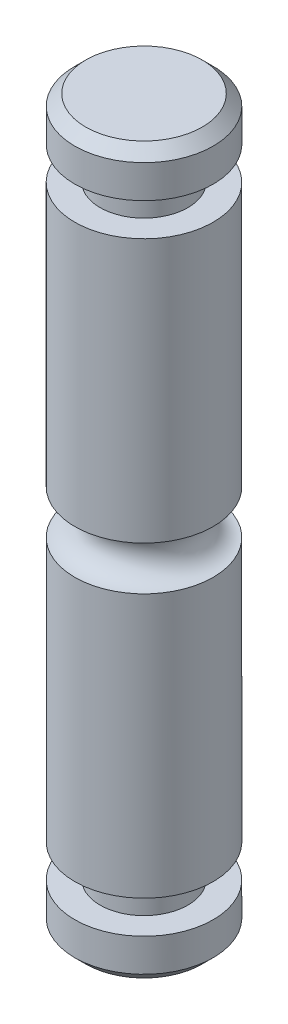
ISO-10303-21;
HEADER;
FILE_DESCRIPTION(('STEP AP214'),'2;1');
FILE_NAME('part.step','',(''),(''),'','','');
FILE_SCHEMA(('AUTOMOTIVE_DESIGN { 1 0 10303 214 1 1 1 1 }'));
ENDSEC;
DATA;
#1=APPLICATION_CONTEXT('core data for automotive mechanical design processes');
#2=APPLICATION_PROTOCOL_DEFINITION('international standard','automotive_design',2000,#1);
#3=PRODUCT_CONTEXT('',#1,'mechanical');
#4=PRODUCT('Part','Part','',(#3));
#5=PRODUCT_RELATED_PRODUCT_CATEGORY('part','',(#4));
#6=PRODUCT_DEFINITION_FORMATION('','',#4);
#7=PRODUCT_DEFINITION_CONTEXT('part definition',#1,'design');
#8=PRODUCT_DEFINITION('design','',#6,#7);
#9=PRODUCT_DEFINITION_SHAPE('','',#8);
#10=(LENGTH_UNIT() NAMED_UNIT(*) SI_UNIT(.MILLI.,.METRE.));
#11=(NAMED_UNIT(*) PLANE_ANGLE_UNIT() SI_UNIT($,.RADIAN.));
#12=(NAMED_UNIT(*) SI_UNIT($,.STERADIAN.) SOLID_ANGLE_UNIT());
#13=UNCERTAINTY_MEASURE_WITH_UNIT(LENGTH_MEASURE(1.E-05),#10,'distance_accuracy_value','');
#14=(GEOMETRIC_REPRESENTATION_CONTEXT(3) GLOBAL_UNCERTAINTY_ASSIGNED_CONTEXT((#13)) GLOBAL_UNIT_ASSIGNED_CONTEXT((#10,
#11,#12)) REPRESENTATION_CONTEXT('',''));
#15=CARTESIAN_POINT('',(0.,0.,0.));
#16=DIRECTION('',(0.,0.,1.));
#17=DIRECTION('',(1.,0.,0.));
#18=AXIS2_PLACEMENT_3D('',#15,#16,#17);
#19=CARTESIAN_POINT('',(0.,-16.5,0.));
#20=DIRECTION('',(0.,1.,0.));
#21=DIRECTION('',(0.,0.,1.));
#22=AXIS2_PLACEMENT_3D('',#19,#20,#21);
#23=CYLINDRICAL_SURFACE('',#22,3.15);
#24=CARTESIAN_POINT('',(0.,0.999999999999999,0.));
#25=DIRECTION('',(0.,-1.,0.));
#26=DIRECTION('',(0.,0.,-1.));
#27=AXIS2_PLACEMENT_3D('',#24,#25,#26);
#28=CIRCLE('',#27,3.15);
#29=CARTESIAN_POINT('',(0.,0.999999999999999,-3.15));
#30=VERTEX_POINT('',#29);
#31=EDGE_CURVE('E58',#30,#30,#28,.T.);
#32=ORIENTED_EDGE('',*,*,#31,.F.);
#33=EDGE_LOOP('',(#32));
#34=FACE_BOUND('',#33,.T.);
#35=CARTESIAN_POINT('',(0.,13.,0.));
#36=DIRECTION('',(0.,-1.,0.));
#37=DIRECTION('',(0.,0.,-1.));
#38=AXIS2_PLACEMENT_3D('',#35,#36,#37);
#39=CIRCLE('',#38,3.15);
#40=CARTESIAN_POINT('',(0.,13.,-3.15));
#41=VERTEX_POINT('',#40);
#42=EDGE_CURVE('E53',#41,#41,#39,.F.);
#43=ORIENTED_EDGE('',*,*,#42,.F.);
#44=EDGE_LOOP('',(#43));
#45=FACE_BOUND('',#44,.T.);
#46=ADVANCED_FACE('F33',(#34,#45),#23,.T.);
#47=CARTESIAN_POINT('',(0.,0.,0.));
#48=DIRECTION('',(0.,-1.,0.));
#49=DIRECTION('',(0.,0.,-1.));
#50=AXIS2_PLACEMENT_3D('',#47,#48,#49);
#51=CYLINDRICAL_SURFACE('',#50,2.);
#52=CARTESIAN_POINT('',(0.,13.,0.));
#53=DIRECTION('',(0.,-1.,0.));
#54=DIRECTION('',(0.,0.,-1.));
#55=AXIS2_PLACEMENT_3D('',#52,#53,#54);
#56=CIRCLE('',#55,2.);
#57=CARTESIAN_POINT('',(0.,13.,-2.));
#58=VERTEX_POINT('',#57);
#59=EDGE_CURVE('E73',#58,#58,#56,.T.);
#60=ORIENTED_EDGE('',*,*,#59,.F.);
#61=EDGE_LOOP('',(#60));
#62=FACE_BOUND('',#61,.T.);
#63=CARTESIAN_POINT('',(0.,14.5,0.));
#64=DIRECTION('',(0.,-1.,0.));
#65=DIRECTION('',(0.,0.,-1.));
#66=AXIS2_PLACEMENT_3D('',#63,#64,#65);
#67=CIRCLE('',#66,2.);
#68=CARTESIAN_POINT('',(0.,14.5,-2.));
#69=VERTEX_POINT('',#68);
#70=EDGE_CURVE('E57',#69,#69,#67,.T.);
#71=ORIENTED_EDGE('',*,*,#70,.T.);
#72=EDGE_LOOP('',(#71));
#73=FACE_BOUND('',#72,.T.);
#74=ADVANCED_FACE('F104',(#62,#73),#51,.T.);
#75=CARTESIAN_POINT('',(0.,13.,-2.));
#76=DIRECTION('',(0.,-1.,0.));
#77=DIRECTION('',(0.,0.,-1.));
#78=AXIS2_PLACEMENT_3D('',#75,#76,#77);
#79=PLANE('',#78);
#80=ORIENTED_EDGE('',*,*,#42,.T.);
#81=EDGE_LOOP('',(#80));
#82=FACE_BOUND('',#81,.T.);
#83=ORIENTED_EDGE('',*,*,#59,.T.);
#84=EDGE_LOOP('',(#83));
#85=FACE_BOUND('',#84,.T.);
#86=ADVANCED_FACE('F111',(#82,#85),#79,.F.);
#87=CARTESIAN_POINT('',(0.,14.5,-2.));
#88=DIRECTION('',(0.,1.,0.));
#89=DIRECTION('',(0.,0.,1.));
#90=AXIS2_PLACEMENT_3D('',#87,#88,#89);
#91=PLANE('',#90);
#92=CARTESIAN_POINT('',(0.,14.5,0.));
#93=DIRECTION('',(0.,1.,0.));
#94=DIRECTION('',(0.,0.,1.));
#95=AXIS2_PLACEMENT_3D('',#92,#93,#94);
#96=CIRCLE('',#95,3.15);
#97=CARTESIAN_POINT('',(0.,14.5,3.15));
#98=VERTEX_POINT('',#97);
#99=EDGE_CURVE('E70',#98,#98,#96,.F.);
#100=ORIENTED_EDGE('',*,*,#99,.T.);
#101=EDGE_LOOP('',(#100));
#102=FACE_BOUND('',#101,.T.);
#103=ORIENTED_EDGE('',*,*,#70,.F.);
#104=EDGE_LOOP('',(#103));
#105=FACE_BOUND('',#104,.T.);
#106=ADVANCED_FACE('F136',(#102,#105),#91,.F.);
#107=CARTESIAN_POINT('',(0.,16.5,0.));
#108=DIRECTION('',(0.,1.,0.));
#109=DIRECTION('',(0.,0.,1.));
#110=AXIS2_PLACEMENT_3D('',#107,#108,#109);
#111=PLANE('',#110);
#112=CARTESIAN_POINT('',(0.,16.5,0.));
#113=DIRECTION('',(0.,1.,0.));
#114=DIRECTION('',(0.,0.,1.));
#115=AXIS2_PLACEMENT_3D('',#112,#113,#114);
#116=CIRCLE('',#115,2.65);
#117=CARTESIAN_POINT('',(0.,16.5,2.65));
#118=VERTEX_POINT('',#117);
#119=EDGE_CURVE('E40',#118,#118,#116,.T.);
#120=ORIENTED_EDGE('',*,*,#119,.T.);
#121=EDGE_LOOP('',(#120));
#122=FACE_BOUND('',#121,.T.);
#123=ADVANCED_FACE('F132',(#122),#111,.T.);
#124=CARTESIAN_POINT('',(0.,16.,0.));
#125=DIRECTION('',(0.,1.,0.));
#126=DIRECTION('',(0.,0.,1.));
#127=AXIS2_PLACEMENT_3D('',#124,#125,#126);
#128=CIRCLE('',#127,3.15);
#129=CARTESIAN_POINT('',(0.,16.,3.15));
#130=VERTEX_POINT('',#129);
#131=EDGE_CURVE('E10',#130,#130,#128,.F.);
#132=ORIENTED_EDGE('',*,*,#131,.T.);
#133=EDGE_LOOP('',(#132));
#134=FACE_BOUND('',#133,.T.);
#135=ORIENTED_EDGE('',*,*,#99,.F.);
#136=EDGE_LOOP('',(#135));
#137=FACE_BOUND('',#136,.T.);
#138=ADVANCED_FACE('F116',(#134,#137),#23,.T.);
#139=CARTESIAN_POINT('',(0.,0.,0.));
#140=DIRECTION('',(0.,-1.,0.));
#141=DIRECTION('',(0.,0.,-1.));
#142=AXIS2_PLACEMENT_3D('',#139,#140,#141);
#143=TOROIDAL_SURFACE('',#142,3.15,0.999999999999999);
#144=CARTESIAN_POINT('',(0.,-0.999999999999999,0.));
#145=DIRECTION('',(0.,1.,0.));
#146=DIRECTION('',(0.,0.,1.));
#147=AXIS2_PLACEMENT_3D('',#144,#145,#146);
#148=CIRCLE('',#147,3.15);
#149=CARTESIAN_POINT('',(0.,-0.999999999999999,3.15));
#150=VERTEX_POINT('',#149);
#151=EDGE_CURVE('E54',#150,#150,#148,.T.);
#152=ORIENTED_EDGE('',*,*,#151,.T.);
#153=EDGE_LOOP('',(#152));
#154=FACE_BOUND('',#153,.T.);
#155=ORIENTED_EDGE('',*,*,#31,.T.);
#156=EDGE_LOOP('',(#155));
#157=FACE_BOUND('',#156,.T.);
#158=ADVANCED_FACE('F122',(#154,#157),#143,.F.);
#159=ORIENTED_EDGE('',*,*,#151,.F.);
#160=EDGE_LOOP('',(#159));
#161=FACE_BOUND('',#160,.T.);
#162=CARTESIAN_POINT('',(0.,-13.,0.));
#163=DIRECTION('',(0.,1.,0.));
#164=DIRECTION('',(0.,0.,1.));
#165=AXIS2_PLACEMENT_3D('',#162,#163,#164);
#166=CIRCLE('',#165,3.15);
#167=CARTESIAN_POINT('',(0.,-13.,3.15));
#168=VERTEX_POINT('',#167);
#169=EDGE_CURVE('E61',#168,#168,#166,.F.);
#170=ORIENTED_EDGE('',*,*,#169,.F.);
#171=EDGE_LOOP('',(#170));
#172=FACE_BOUND('',#171,.T.);
#173=ADVANCED_FACE('F90',(#161,#172),#23,.T.);
#174=CARTESIAN_POINT('',(0.,0.,0.));
#175=DIRECTION('',(0.,-1.,0.));
#176=DIRECTION('',(0.,0.,-1.));
#177=AXIS2_PLACEMENT_3D('',#174,#175,#176);
#178=CYLINDRICAL_SURFACE('',#177,2.);
#179=CARTESIAN_POINT('',(0.,-14.5,0.));
#180=DIRECTION('',(0.,-1.,0.));
#181=DIRECTION('',(0.,0.,-1.));
#182=AXIS2_PLACEMENT_3D('',#179,#180,#181);
#183=CIRCLE('',#182,2.);
#184=CARTESIAN_POINT('',(0.,-14.5,-2.));
#185=VERTEX_POINT('',#184);
#186=EDGE_CURVE('E80',#185,#185,#183,.T.);
#187=ORIENTED_EDGE('',*,*,#186,.F.);
#188=EDGE_LOOP('',(#187));
#189=FACE_BOUND('',#188,.T.);
#190=CARTESIAN_POINT('',(0.,-13.,0.));
#191=DIRECTION('',(0.,-1.,0.));
#192=DIRECTION('',(0.,0.,-1.));
#193=AXIS2_PLACEMENT_3D('',#190,#191,#192);
#194=CIRCLE('',#193,2.);
#195=CARTESIAN_POINT('',(0.,-13.,-2.));
#196=VERTEX_POINT('',#195);
#197=EDGE_CURVE('E67',#196,#196,#194,.T.);
#198=ORIENTED_EDGE('',*,*,#197,.T.);
#199=EDGE_LOOP('',(#198));
#200=FACE_BOUND('',#199,.T.);
#201=ADVANCED_FACE('F86',(#189,#200),#178,.T.);
#202=CARTESIAN_POINT('',(0.,-13.,-2.));
#203=DIRECTION('',(0.,1.,0.));
#204=DIRECTION('',(0.,0.,1.));
#205=AXIS2_PLACEMENT_3D('',#202,#203,#204);
#206=PLANE('',#205);
#207=ORIENTED_EDGE('',*,*,#169,.T.);
#208=EDGE_LOOP('',(#207));
#209=FACE_BOUND('',#208,.T.);
#210=ORIENTED_EDGE('',*,*,#197,.F.);
#211=EDGE_LOOP('',(#210));
#212=FACE_BOUND('',#211,.T.);
#213=ADVANCED_FACE('F89',(#209,#212),#206,.F.);
#214=CARTESIAN_POINT('',(0.,-14.5,-2.));
#215=DIRECTION('',(0.,-1.,0.));
#216=DIRECTION('',(0.,0.,-1.));
#217=AXIS2_PLACEMENT_3D('',#214,#215,#216);
#218=PLANE('',#217);
#219=CARTESIAN_POINT('',(0.,-14.5,0.));
#220=DIRECTION('',(0.,-1.,0.));
#221=DIRECTION('',(0.,0.,-1.));
#222=AXIS2_PLACEMENT_3D('',#219,#220,#221);
#223=CIRCLE('',#222,3.15);
#224=CARTESIAN_POINT('',(0.,-14.5,-3.15));
#225=VERTEX_POINT('',#224);
#226=EDGE_CURVE('E64',#225,#225,#223,.F.);
#227=ORIENTED_EDGE('',*,*,#226,.T.);
#228=EDGE_LOOP('',(#227));
#229=FACE_BOUND('',#228,.T.);
#230=ORIENTED_EDGE('',*,*,#186,.T.);
#231=EDGE_LOOP('',(#230));
#232=FACE_BOUND('',#231,.T.);
#233=ADVANCED_FACE('F84',(#229,#232),#218,.F.);
#234=CARTESIAN_POINT('',(0.,-16.5,0.));
#235=DIRECTION('',(0.,1.,0.));
#236=DIRECTION('',(0.,0.,1.));
#237=AXIS2_PLACEMENT_3D('',#234,#235,#236);
#238=PLANE('',#237);
#239=CARTESIAN_POINT('',(0.,-16.5,0.));
#240=DIRECTION('',(0.,1.,0.));
#241=DIRECTION('',(0.,0.,1.));
#242=AXIS2_PLACEMENT_3D('',#239,#240,#241);
#243=CIRCLE('',#242,2.65);
#244=CARTESIAN_POINT('',(0.,-16.5,2.65));
#245=VERTEX_POINT('',#244);
#246=EDGE_CURVE('E44',#245,#245,#243,.F.);
#247=ORIENTED_EDGE('',*,*,#246,.T.);
#248=EDGE_LOOP('',(#247));
#249=FACE_BOUND('',#248,.T.);
#250=ADVANCED_FACE('F100',(#249),#238,.F.);
#251=CARTESIAN_POINT('',(0.,-16.,0.));
#252=DIRECTION('',(0.,1.,0.));
#253=DIRECTION('',(0.,0.,1.));
#254=AXIS2_PLACEMENT_3D('',#251,#252,#253);
#255=CIRCLE('',#254,3.15);
#256=CARTESIAN_POINT('',(0.,-16.,3.15));
#257=VERTEX_POINT('',#256);
#258=EDGE_CURVE('E48',#257,#257,#255,.T.);
#259=ORIENTED_EDGE('',*,*,#258,.T.);
#260=EDGE_LOOP('',(#259));
#261=FACE_BOUND('',#260,.T.);
#262=ORIENTED_EDGE('',*,*,#226,.F.);
#263=EDGE_LOOP('',(#262));
#264=FACE_BOUND('',#263,.T.);
#265=ADVANCED_FACE('F107',(#261,#264),#23,.T.);
#266=CARTESIAN_POINT('',(0.,-16.,0.));
#267=DIRECTION('',(0.,1.,0.));
#268=DIRECTION('',(0.,0.,1.));
#269=AXIS2_PLACEMENT_3D('',#266,#267,#268);
#270=CONICAL_SURFACE('',#269,3.15,0.785398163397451);
#271=ORIENTED_EDGE('',*,*,#246,.F.);
#272=EDGE_LOOP('',(#271));
#273=FACE_BOUND('',#272,.T.);
#274=ORIENTED_EDGE('',*,*,#258,.F.);
#275=EDGE_LOOP('',(#274));
#276=FACE_BOUND('',#275,.T.);
#277=ADVANCED_FACE('F119',(#273,#276),#270,.T.);
#278=CARTESIAN_POINT('',(0.,16.5,0.));
#279=DIRECTION('',(0.,-1.,0.));
#280=DIRECTION('',(0.,0.,-1.));
#281=AXIS2_PLACEMENT_3D('',#278,#279,#280);
#282=CONICAL_SURFACE('',#281,2.65,0.785398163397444);
#283=ORIENTED_EDGE('',*,*,#131,.F.);
#284=EDGE_LOOP('',(#283));
#285=FACE_BOUND('',#284,.T.);
#286=ORIENTED_EDGE('',*,*,#119,.F.);
#287=EDGE_LOOP('',(#286));
#288=FACE_BOUND('',#287,.T.);
#289=ADVANCED_FACE('F35',(#285,#288),#282,.T.);
#290=CLOSED_SHELL('',(#46,#74,#86,#106,#123,#138,#158,#173,#201,#213,#233,#250,#265,#277,#289));
#291=MANIFOLD_SOLID_BREP('B2',#290);
#292=ADVANCED_BREP_SHAPE_REPRESENTATION('',(#18,#291),#14);
#293=SHAPE_DEFINITION_REPRESENTATION(#9,#292);
ENDSEC;
END-ISO-10303-21;
